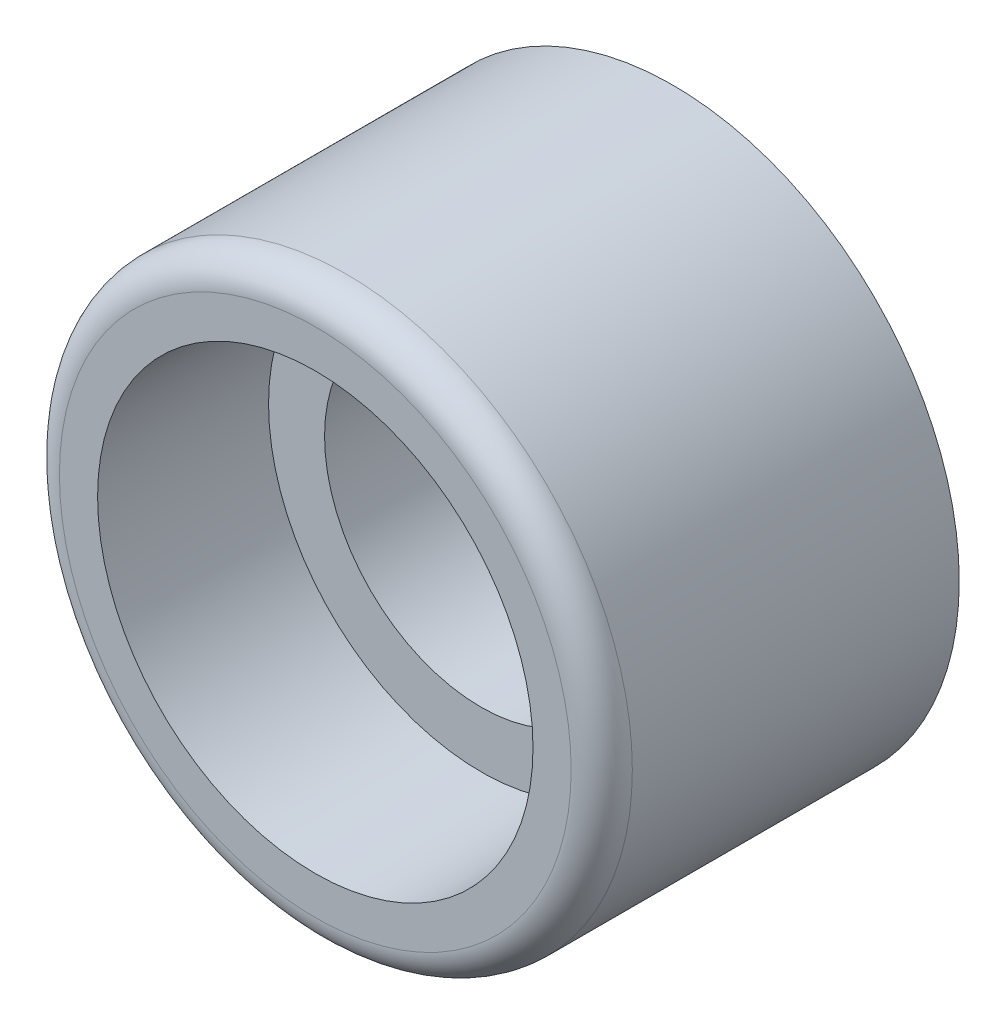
from build123d import *

# Parameters (mm, degrees)
BODYSCH_R  = 31.75
BODY_DEPTH = 19.812
FLOWSCH_R  = 17.35074
FLOW_DEPTH = 39.624
FILLET1_R  = 3.38963


with BuildPart() as part:
    # BodySch → Body (new, symmetric)
    with BuildSketch(Plane.XY):
        Circle(BODYSCH_R)
    extrude(amount=BODY_DEPTH, both=True)

    # FlowSch → Flow (cut)
    with BuildSketch(Plane.XY.offset(-19.812)):
        Circle(FLOWSCH_R)
    extrude(amount=FLOW_DEPTH, mode=Mode.SUBTRACT)

    # ThreadSch → Thread (revolve, cut)
    with BuildSketch(Plane(origin=(0, 0, 0), x_dir=(0, 0, -1), z_dir=(1, 0, 0)), mode=Mode.PRIVATE) as thread_sk:
        Polygon((-1.4351, 0), (-1.4351, 23.557833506), (-19.812, 24.13), (-19.812, 0), align=None)
    revolve(thread_sk.sketch.rotate(Axis((0, 0, 0), (0, 0, 1)), 90), axis=Axis((0, 0, 0), (0, 0, 1)), mode=Mode.SUBTRACT)

    # Fillet1
    fillet1_edges = [part.edges().sort_by_distance(p)[0] for p in [
        (-31.75, 0, 19.812),
    ]]
    fillet(fillet1_edges, radius=FILLET1_R)


solid = part.part
